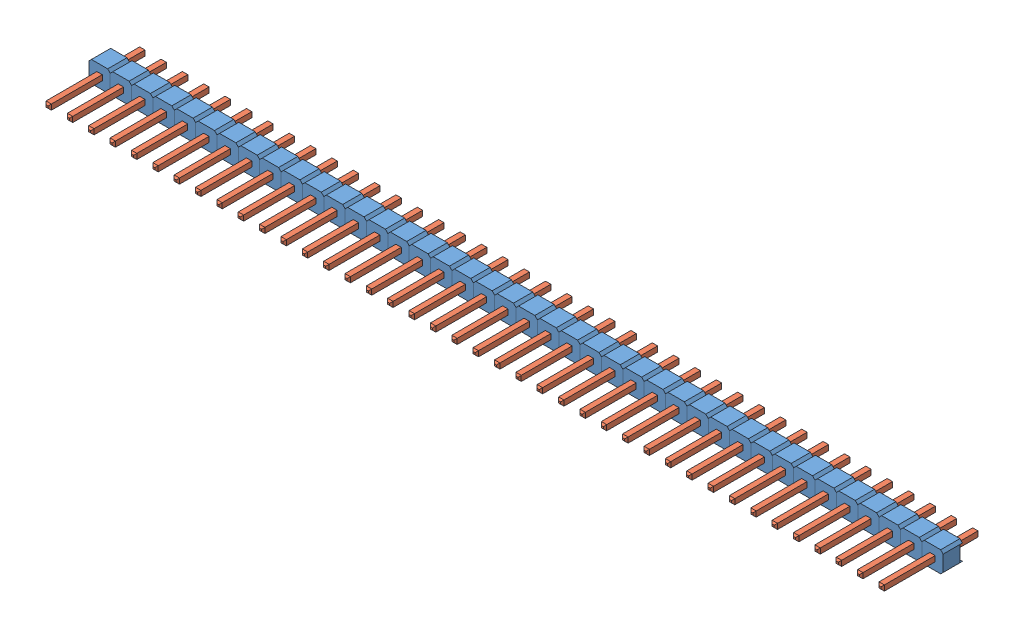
SolidWorks assembly User Library-Header_Male_40Pin.sldasm, configuration Default (file format 15000). Lengths in mm.
Overall size (101.6 2.49 11.54).
2 component instances, 2 part files, 0 mates.
Components (placement in the parent):
- User Library-Header_Male_40Pin_BodyArray-1: User Library-Header_Male_40Pin_BodyArray.sldprt [Default] at origin size (101.6 2.49 2.29)
- User Library-Header_Male_40Pin_PinArray-1: User Library-Header_Male_40Pin_PinArray.sldprt [Default] at origin size (99.7 0.64 11.54)
